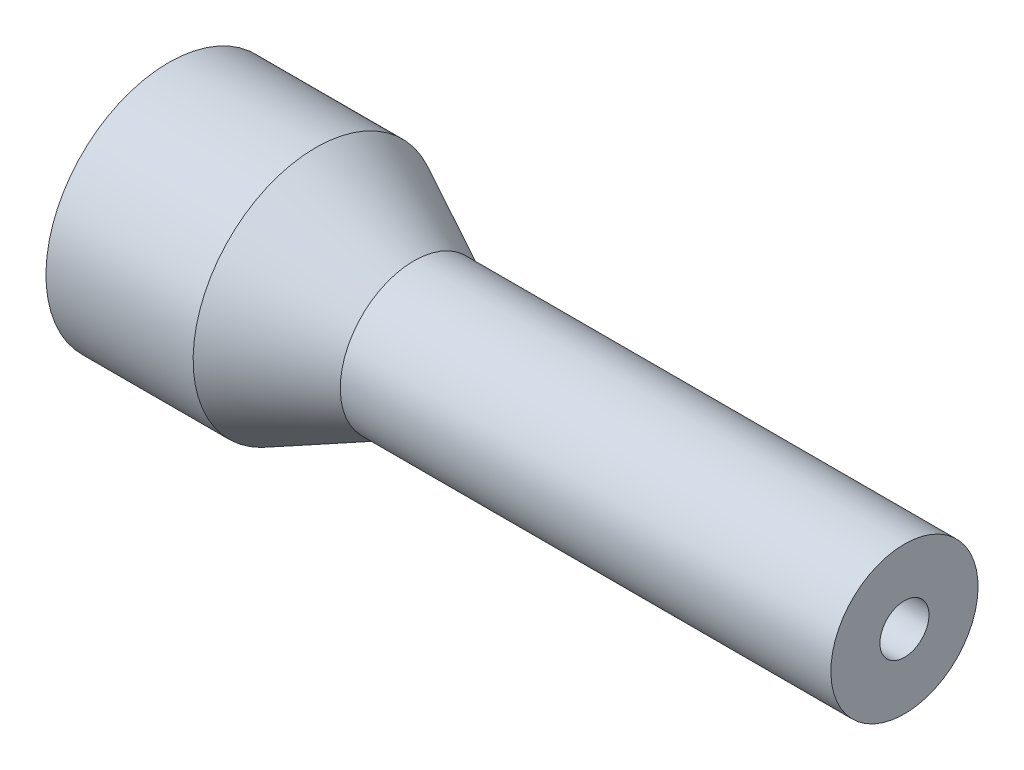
from build123d import *


with BuildPart() as part:
    # Szkic1 → Obr_t1 (revolve)
    with BuildSketch(Plane.XY):
        Polygon((0, 19), (0, 25), (30, 25), (50, 15), (150, 15), (150, 5), (130, 5), (127.113248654, 0), (25, 0), (25, 19), align=None)
    revolve(axis=Axis((25, 0, 0), (-1, 0, 0)))


solid = part.part
